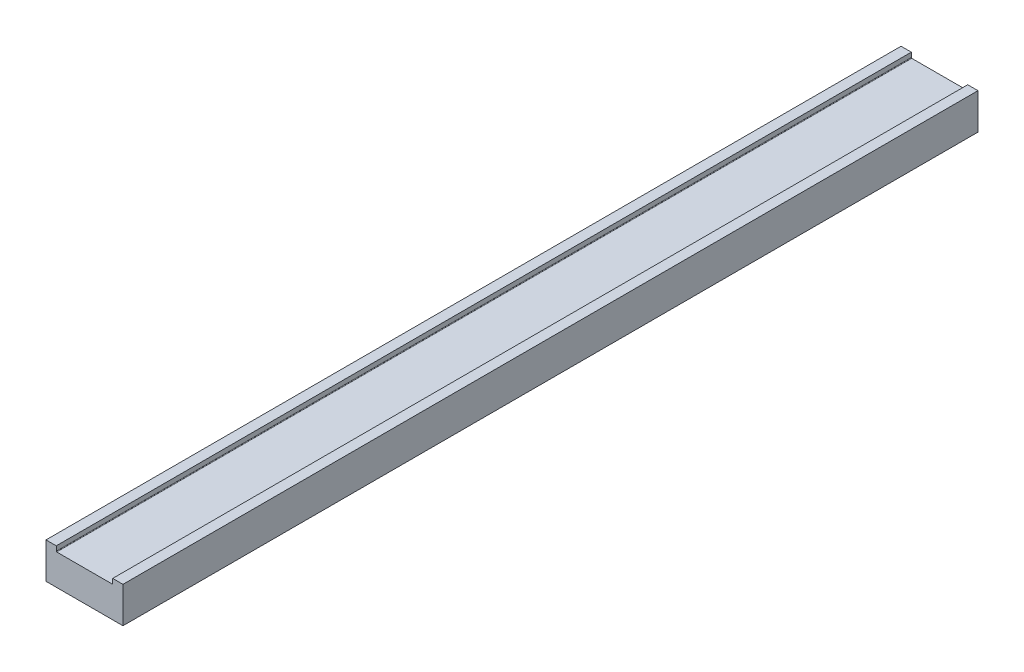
ISO-10303-21;
HEADER;
FILE_DESCRIPTION(('STEP AP214'),'2;1');
FILE_NAME('part.step','',(''),(''),'','','');
FILE_SCHEMA(('AUTOMOTIVE_DESIGN { 1 0 10303 214 1 1 1 1 }'));
ENDSEC;
DATA;
#1=APPLICATION_CONTEXT('core data for automotive mechanical design processes');
#2=APPLICATION_PROTOCOL_DEFINITION('international standard','automotive_design',2000,#1);
#3=PRODUCT_CONTEXT('',#1,'mechanical');
#4=PRODUCT('Part','Part','',(#3));
#5=PRODUCT_RELATED_PRODUCT_CATEGORY('part','',(#4));
#6=PRODUCT_DEFINITION_FORMATION('','',#4);
#7=PRODUCT_DEFINITION_CONTEXT('part definition',#1,'design');
#8=PRODUCT_DEFINITION('design','',#6,#7);
#9=PRODUCT_DEFINITION_SHAPE('','',#8);
#10=(LENGTH_UNIT() NAMED_UNIT(*) SI_UNIT(.MILLI.,.METRE.));
#11=(NAMED_UNIT(*) PLANE_ANGLE_UNIT() SI_UNIT($,.RADIAN.));
#12=(NAMED_UNIT(*) SI_UNIT($,.STERADIAN.) SOLID_ANGLE_UNIT());
#13=UNCERTAINTY_MEASURE_WITH_UNIT(LENGTH_MEASURE(1.E-05),#10,'distance_accuracy_value','');
#14=(GEOMETRIC_REPRESENTATION_CONTEXT(3) GLOBAL_UNCERTAINTY_ASSIGNED_CONTEXT((#13)) GLOBAL_UNIT_ASSIGNED_CONTEXT((#10,
#11,#12)) REPRESENTATION_CONTEXT('',''));
#15=CARTESIAN_POINT('',(0.,0.,0.));
#16=DIRECTION('',(0.,0.,1.));
#17=DIRECTION('',(1.,0.,0.));
#18=AXIS2_PLACEMENT_3D('',#15,#16,#17);
#19=CARTESIAN_POINT('',(-22.5,21.,0.));
#20=DIRECTION('',(-1.,0.,0.));
#21=DIRECTION('',(0.,0.,1.));
#22=AXIS2_PLACEMENT_3D('',#19,#20,#21);
#23=PLANE('',#22);
#24=DIRECTION('',(0.,0.,1.));
#25=VECTOR('',#24,1.);
#26=CARTESIAN_POINT('',(-22.5,21.,0.));
#27=LINE('',#26,#25);
#28=CARTESIAN_POINT('',(-22.5,21.,0.));
#29=VERTEX_POINT('',#28);
#30=CARTESIAN_POINT('',(-22.5,21.,500.));
#31=VERTEX_POINT('',#30);
#32=EDGE_CURVE('E9',#29,#31,#27,.T.);
#33=ORIENTED_EDGE('',*,*,#32,.F.);
#34=DIRECTION('',(0.,-1.,0.));
#35=VECTOR('',#34,1.);
#36=CARTESIAN_POINT('',(-22.5,21.,0.));
#37=LINE('',#36,#35);
#38=CARTESIAN_POINT('',(-22.5,0.,0.));
#39=VERTEX_POINT('',#38);
#40=EDGE_CURVE('E91',#29,#39,#37,.T.);
#41=ORIENTED_EDGE('',*,*,#40,.T.);
#42=DIRECTION('',(0.,0.,1.));
#43=VECTOR('',#42,1.);
#44=CARTESIAN_POINT('',(-22.5,0.,0.));
#45=LINE('',#44,#43);
#46=CARTESIAN_POINT('',(-22.5,0.,500.));
#47=VERTEX_POINT('',#46);
#48=EDGE_CURVE('E87',#39,#47,#45,.T.);
#49=ORIENTED_EDGE('',*,*,#48,.T.);
#50=DIRECTION('',(0.,-1.,0.));
#51=VECTOR('',#50,1.);
#52=CARTESIAN_POINT('',(-22.5,21.,500.));
#53=LINE('',#52,#51);
#54=EDGE_CURVE('E89',#31,#47,#53,.T.);
#55=ORIENTED_EDGE('',*,*,#54,.F.);
#56=EDGE_LOOP('',(#33,#41,#49,#55));
#57=FACE_BOUND('',#56,.T.);
#58=ADVANCED_FACE('F14',(#57),#23,.T.);
#59=CARTESIAN_POINT('',(-22.5,21.,0.));
#60=DIRECTION('',(0.,-1.,0.));
#61=DIRECTION('',(0.,0.,-1.));
#62=AXIS2_PLACEMENT_3D('',#59,#60,#61);
#63=PLANE('',#62);
#64=DIRECTION('',(0.,0.,1.));
#65=VECTOR('',#64,1.);
#66=CARTESIAN_POINT('',(-16.5,21.,0.));
#67=LINE('',#66,#65);
#68=CARTESIAN_POINT('',(-16.5,21.,0.));
#69=VERTEX_POINT('',#68);
#70=CARTESIAN_POINT('',(-16.5,21.,500.));
#71=VERTEX_POINT('',#70);
#72=EDGE_CURVE('E22',#69,#71,#67,.T.);
#73=ORIENTED_EDGE('',*,*,#72,.F.);
#74=DIRECTION('',(1.,0.,0.));
#75=VECTOR('',#74,1.);
#76=CARTESIAN_POINT('',(-22.5,21.,0.));
#77=LINE('',#76,#75);
#78=EDGE_CURVE('E97',#29,#69,#77,.T.);
#79=ORIENTED_EDGE('',*,*,#78,.F.);
#80=ORIENTED_EDGE('',*,*,#32,.T.);
#81=DIRECTION('',(1.,0.,0.));
#82=VECTOR('',#81,1.);
#83=CARTESIAN_POINT('',(-22.5,21.,500.));
#84=LINE('',#83,#82);
#85=EDGE_CURVE('E106',#31,#71,#84,.T.);
#86=ORIENTED_EDGE('',*,*,#85,.T.);
#87=EDGE_LOOP('',(#73,#79,#80,#86));
#88=FACE_BOUND('',#87,.T.);
#89=ADVANCED_FACE('F16',(#88),#63,.F.);
#90=CARTESIAN_POINT('',(-16.5,21.,0.));
#91=DIRECTION('',(-1.,0.,0.));
#92=DIRECTION('',(0.,0.,1.));
#93=AXIS2_PLACEMENT_3D('',#90,#91,#92);
#94=PLANE('',#93);
#95=DIRECTION('',(0.,0.,1.));
#96=VECTOR('',#95,1.);
#97=CARTESIAN_POINT('',(-16.5,18.3,0.));
#98=LINE('',#97,#96);
#99=CARTESIAN_POINT('',(-16.5,18.3,0.));
#100=VERTEX_POINT('',#99);
#101=CARTESIAN_POINT('',(-16.5,18.3,500.));
#102=VERTEX_POINT('',#101);
#103=EDGE_CURVE('E169',#100,#102,#98,.T.);
#104=ORIENTED_EDGE('',*,*,#103,.F.);
#105=DIRECTION('',(0.,-1.,0.));
#106=VECTOR('',#105,1.);
#107=CARTESIAN_POINT('',(-16.5,21.,0.));
#108=LINE('',#107,#106);
#109=EDGE_CURVE('E153',#69,#100,#108,.T.);
#110=ORIENTED_EDGE('',*,*,#109,.F.);
#111=ORIENTED_EDGE('',*,*,#72,.T.);
#112=DIRECTION('',(0.,-1.,0.));
#113=VECTOR('',#112,1.);
#114=CARTESIAN_POINT('',(-16.5,21.,500.));
#115=LINE('',#114,#113);
#116=EDGE_CURVE('E128',#71,#102,#115,.T.);
#117=ORIENTED_EDGE('',*,*,#116,.T.);
#118=EDGE_LOOP('',(#104,#110,#111,#117));
#119=FACE_BOUND('',#118,.T.);
#120=ADVANCED_FACE('F171',(#119),#94,.F.);
#121=CARTESIAN_POINT('',(-16.2,18.3,0.));
#122=DIRECTION('',(0.,0.,1.));
#123=DIRECTION('',(1.,0.,0.));
#124=AXIS2_PLACEMENT_3D('',#121,#122,#123);
#125=CYLINDRICAL_SURFACE('',#124,0.299999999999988);
#126=DIRECTION('',(0.,0.,1.));
#127=VECTOR('',#126,1.);
#128=CARTESIAN_POINT('',(-16.2,18.,0.));
#129=LINE('',#128,#127);
#130=CARTESIAN_POINT('',(-16.2,18.,0.));
#131=VERTEX_POINT('',#130);
#132=CARTESIAN_POINT('',(-16.2,18.,500.));
#133=VERTEX_POINT('',#132);
#134=EDGE_CURVE('E167',#131,#133,#129,.T.);
#135=ORIENTED_EDGE('',*,*,#134,.F.);
#136=CARTESIAN_POINT('',(-16.2,18.3,0.));
#137=DIRECTION('',(0.,0.,1.));
#138=DIRECTION('',(1.,0.,0.));
#139=AXIS2_PLACEMENT_3D('',#136,#137,#138);
#140=CIRCLE('',#139,0.299999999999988);
#141=EDGE_CURVE('E150',#100,#131,#140,.T.);
#142=ORIENTED_EDGE('',*,*,#141,.F.);
#143=ORIENTED_EDGE('',*,*,#103,.T.);
#144=CARTESIAN_POINT('',(-16.2,18.3,500.));
#145=DIRECTION('',(0.,0.,1.));
#146=DIRECTION('',(1.,0.,0.));
#147=AXIS2_PLACEMENT_3D('',#144,#145,#146);
#148=CIRCLE('',#147,0.299999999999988);
#149=EDGE_CURVE('E125',#102,#133,#148,.T.);
#150=ORIENTED_EDGE('',*,*,#149,.T.);
#151=EDGE_LOOP('',(#135,#142,#143,#150));
#152=FACE_BOUND('',#151,.T.);
#153=ADVANCED_FACE('F195',(#152),#125,.F.);
#154=CARTESIAN_POINT('',(-16.2,18.,0.));
#155=DIRECTION('',(0.,-1.,0.));
#156=DIRECTION('',(1.,0.,0.));
#157=AXIS2_PLACEMENT_3D('',#154,#155,#156);
#158=PLANE('',#157);
#159=DIRECTION('',(0.,0.,1.));
#160=VECTOR('',#159,1.);
#161=CARTESIAN_POINT('',(16.2,18.,0.));
#162=LINE('',#161,#160);
#163=CARTESIAN_POINT('',(16.2,18.,0.));
#164=VERTEX_POINT('',#163);
#165=CARTESIAN_POINT('',(16.2,18.,500.));
#166=VERTEX_POINT('',#165);
#167=EDGE_CURVE('E165',#164,#166,#162,.T.);
#168=ORIENTED_EDGE('',*,*,#167,.F.);
#169=DIRECTION('',(1.,0.,0.));
#170=VECTOR('',#169,1.);
#171=CARTESIAN_POINT('',(-16.2,18.,0.));
#172=LINE('',#171,#170);
#173=EDGE_CURVE('E147',#131,#164,#172,.T.);
#174=ORIENTED_EDGE('',*,*,#173,.F.);
#175=ORIENTED_EDGE('',*,*,#134,.T.);
#176=DIRECTION('',(1.,0.,0.));
#177=VECTOR('',#176,1.);
#178=CARTESIAN_POINT('',(-16.2,18.,500.));
#179=LINE('',#178,#177);
#180=EDGE_CURVE('E122',#133,#166,#179,.T.);
#181=ORIENTED_EDGE('',*,*,#180,.T.);
#182=EDGE_LOOP('',(#168,#174,#175,#181));
#183=FACE_BOUND('',#182,.T.);
#184=ADVANCED_FACE('F193',(#183),#158,.F.);
#185=CARTESIAN_POINT('',(16.2,18.3,0.));
#186=DIRECTION('',(0.,0.,1.));
#187=DIRECTION('',(1.,0.,0.));
#188=AXIS2_PLACEMENT_3D('',#185,#186,#187);
#189=CYLINDRICAL_SURFACE('',#188,0.299999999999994);
#190=DIRECTION('',(0.,0.,1.));
#191=VECTOR('',#190,1.);
#192=CARTESIAN_POINT('',(16.5,18.3,0.));
#193=LINE('',#192,#191);
#194=CARTESIAN_POINT('',(16.5,18.3,0.));
#195=VERTEX_POINT('',#194);
#196=CARTESIAN_POINT('',(16.5,18.3,500.));
#197=VERTEX_POINT('',#196);
#198=EDGE_CURVE('E163',#195,#197,#193,.T.);
#199=ORIENTED_EDGE('',*,*,#198,.F.);
#200=CARTESIAN_POINT('',(16.2,18.3,0.));
#201=DIRECTION('',(0.,0.,1.));
#202=DIRECTION('',(1.,0.,0.));
#203=AXIS2_PLACEMENT_3D('',#200,#201,#202);
#204=CIRCLE('',#203,0.299999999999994);
#205=EDGE_CURVE('E144',#164,#195,#204,.T.);
#206=ORIENTED_EDGE('',*,*,#205,.F.);
#207=ORIENTED_EDGE('',*,*,#167,.T.);
#208=CARTESIAN_POINT('',(16.2,18.3,500.));
#209=DIRECTION('',(0.,0.,1.));
#210=DIRECTION('',(1.,0.,0.));
#211=AXIS2_PLACEMENT_3D('',#208,#209,#210);
#212=CIRCLE('',#211,0.299999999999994);
#213=EDGE_CURVE('E119',#166,#197,#212,.T.);
#214=ORIENTED_EDGE('',*,*,#213,.T.);
#215=EDGE_LOOP('',(#199,#206,#207,#214));
#216=FACE_BOUND('',#215,.T.);
#217=ADVANCED_FACE('F189',(#216),#189,.F.);
#218=CARTESIAN_POINT('',(16.5,21.,0.));
#219=DIRECTION('',(-1.,0.,0.));
#220=DIRECTION('',(0.,0.,1.));
#221=AXIS2_PLACEMENT_3D('',#218,#219,#220);
#222=PLANE('',#221);
#223=DIRECTION('',(0.,0.,1.));
#224=VECTOR('',#223,1.);
#225=CARTESIAN_POINT('',(16.5,21.,0.));
#226=LINE('',#225,#224);
#227=CARTESIAN_POINT('',(16.5,21.,0.));
#228=VERTEX_POINT('',#227);
#229=CARTESIAN_POINT('',(16.5,21.,500.));
#230=VERTEX_POINT('',#229);
#231=EDGE_CURVE('E161',#228,#230,#226,.T.);
#232=ORIENTED_EDGE('',*,*,#231,.F.);
#233=DIRECTION('',(0.,-1.,0.));
#234=VECTOR('',#233,1.);
#235=CARTESIAN_POINT('',(16.5,21.,0.));
#236=LINE('',#235,#234);
#237=EDGE_CURVE('E141',#228,#195,#236,.T.);
#238=ORIENTED_EDGE('',*,*,#237,.T.);
#239=ORIENTED_EDGE('',*,*,#198,.T.);
#240=DIRECTION('',(0.,-1.,0.));
#241=VECTOR('',#240,1.);
#242=CARTESIAN_POINT('',(16.5,21.,500.));
#243=LINE('',#242,#241);
#244=EDGE_CURVE('E116',#230,#197,#243,.T.);
#245=ORIENTED_EDGE('',*,*,#244,.F.);
#246=EDGE_LOOP('',(#232,#238,#239,#245));
#247=FACE_BOUND('',#246,.T.);
#248=ADVANCED_FACE('F186',(#247),#222,.T.);
#249=CARTESIAN_POINT('',(16.5,21.,0.));
#250=DIRECTION('',(0.,-1.,0.));
#251=DIRECTION('',(1.,0.,0.));
#252=AXIS2_PLACEMENT_3D('',#249,#250,#251);
#253=PLANE('',#252);
#254=DIRECTION('',(0.,0.,1.));
#255=VECTOR('',#254,1.);
#256=CARTESIAN_POINT('',(22.5,21.,0.));
#257=LINE('',#256,#255);
#258=CARTESIAN_POINT('',(22.5,21.,0.));
#259=VERTEX_POINT('',#258);
#260=CARTESIAN_POINT('',(22.5,21.,500.));
#261=VERTEX_POINT('',#260);
#262=EDGE_CURVE('E159',#259,#261,#257,.T.);
#263=ORIENTED_EDGE('',*,*,#262,.F.);
#264=DIRECTION('',(1.,0.,0.));
#265=VECTOR('',#264,1.);
#266=CARTESIAN_POINT('',(16.5,21.,0.));
#267=LINE('',#266,#265);
#268=EDGE_CURVE('E138',#228,#259,#267,.T.);
#269=ORIENTED_EDGE('',*,*,#268,.F.);
#270=ORIENTED_EDGE('',*,*,#231,.T.);
#271=DIRECTION('',(1.,0.,0.));
#272=VECTOR('',#271,1.);
#273=CARTESIAN_POINT('',(16.5,21.,500.));
#274=LINE('',#273,#272);
#275=EDGE_CURVE('E111',#230,#261,#274,.T.);
#276=ORIENTED_EDGE('',*,*,#275,.T.);
#277=EDGE_LOOP('',(#263,#269,#270,#276));
#278=FACE_BOUND('',#277,.T.);
#279=ADVANCED_FACE('F184',(#278),#253,.F.);
#280=CARTESIAN_POINT('',(22.5,21.,0.));
#281=DIRECTION('',(-1.,0.,0.));
#282=DIRECTION('',(0.,0.,1.));
#283=AXIS2_PLACEMENT_3D('',#280,#281,#282);
#284=PLANE('',#283);
#285=DIRECTION('',(0.,0.,1.));
#286=VECTOR('',#285,1.);
#287=CARTESIAN_POINT('',(22.5,0.,0.));
#288=LINE('',#287,#286);
#289=CARTESIAN_POINT('',(22.5,0.,0.));
#290=VERTEX_POINT('',#289);
#291=CARTESIAN_POINT('',(22.5,0.,500.));
#292=VERTEX_POINT('',#291);
#293=EDGE_CURVE('E96',#290,#292,#288,.T.);
#294=ORIENTED_EDGE('',*,*,#293,.F.);
#295=DIRECTION('',(0.,-1.,0.));
#296=VECTOR('',#295,1.);
#297=CARTESIAN_POINT('',(22.5,21.,0.));
#298=LINE('',#297,#296);
#299=EDGE_CURVE('E135',#259,#290,#298,.T.);
#300=ORIENTED_EDGE('',*,*,#299,.F.);
#301=ORIENTED_EDGE('',*,*,#262,.T.);
#302=DIRECTION('',(0.,-1.,0.));
#303=VECTOR('',#302,1.);
#304=CARTESIAN_POINT('',(22.5,21.,500.));
#305=LINE('',#304,#303);
#306=EDGE_CURVE('E109',#261,#292,#305,.T.);
#307=ORIENTED_EDGE('',*,*,#306,.T.);
#308=EDGE_LOOP('',(#294,#300,#301,#307));
#309=FACE_BOUND('',#308,.T.);
#310=ADVANCED_FACE('F180',(#309),#284,.F.);
#311=CARTESIAN_POINT('',(-22.5,0.,0.));
#312=DIRECTION('',(0.,-1.,0.));
#313=DIRECTION('',(0.,0.,-1.));
#314=AXIS2_PLACEMENT_3D('',#311,#312,#313);
#315=PLANE('',#314);
#316=DIRECTION('',(1.,0.,0.));
#317=VECTOR('',#316,1.);
#318=CARTESIAN_POINT('',(-22.5,0.,0.));
#319=LINE('',#318,#317);
#320=EDGE_CURVE('E133',#39,#290,#319,.T.);
#321=ORIENTED_EDGE('',*,*,#320,.T.);
#322=ORIENTED_EDGE('',*,*,#293,.T.);
#323=DIRECTION('',(1.,0.,0.));
#324=VECTOR('',#323,1.);
#325=CARTESIAN_POINT('',(-22.5,0.,500.));
#326=LINE('',#325,#324);
#327=EDGE_CURVE('E103',#47,#292,#326,.T.);
#328=ORIENTED_EDGE('',*,*,#327,.F.);
#329=ORIENTED_EDGE('',*,*,#48,.F.);
#330=EDGE_LOOP('',(#321,#322,#328,#329));
#331=FACE_BOUND('',#330,.T.);
#332=ADVANCED_FACE('F108',(#331),#315,.T.);
#333=CARTESIAN_POINT('',(16.2,18.3,0.));
#334=DIRECTION('',(0.,0.,1.));
#335=DIRECTION('',(1.,0.,0.));
#336=AXIS2_PLACEMENT_3D('',#333,#334,#335);
#337=PLANE('',#336);
#338=ORIENTED_EDGE('',*,*,#40,.F.);
#339=ORIENTED_EDGE('',*,*,#78,.T.);
#340=ORIENTED_EDGE('',*,*,#109,.T.);
#341=ORIENTED_EDGE('',*,*,#141,.T.);
#342=ORIENTED_EDGE('',*,*,#173,.T.);
#343=ORIENTED_EDGE('',*,*,#205,.T.);
#344=ORIENTED_EDGE('',*,*,#237,.F.);
#345=ORIENTED_EDGE('',*,*,#268,.T.);
#346=ORIENTED_EDGE('',*,*,#299,.T.);
#347=ORIENTED_EDGE('',*,*,#320,.F.);
#348=EDGE_LOOP('',(#338,#339,#340,#341,#342,#343,#344,#345,#346,#347));
#349=FACE_BOUND('',#348,.T.);
#350=ADVANCED_FACE('F175',(#349),#337,.F.);
#351=CARTESIAN_POINT('',(16.2,18.3,500.));
#352=DIRECTION('',(0.,0.,1.));
#353=DIRECTION('',(1.,0.,0.));
#354=AXIS2_PLACEMENT_3D('',#351,#352,#353);
#355=PLANE('',#354);
#356=ORIENTED_EDGE('',*,*,#54,.T.);
#357=ORIENTED_EDGE('',*,*,#327,.T.);
#358=ORIENTED_EDGE('',*,*,#306,.F.);
#359=ORIENTED_EDGE('',*,*,#275,.F.);
#360=ORIENTED_EDGE('',*,*,#244,.T.);
#361=ORIENTED_EDGE('',*,*,#213,.F.);
#362=ORIENTED_EDGE('',*,*,#180,.F.);
#363=ORIENTED_EDGE('',*,*,#149,.F.);
#364=ORIENTED_EDGE('',*,*,#116,.F.);
#365=ORIENTED_EDGE('',*,*,#85,.F.);
#366=EDGE_LOOP('',(#356,#357,#358,#359,#360,#361,#362,#363,#364,#365));
#367=FACE_BOUND('',#366,.T.);
#368=ADVANCED_FACE('F101',(#367),#355,.T.);
#369=CLOSED_SHELL('',(#58,#89,#120,#153,#184,#217,#248,#279,#310,#332,#350,#368));
#370=MANIFOLD_SOLID_BREP('B1',#369);
#371=ADVANCED_BREP_SHAPE_REPRESENTATION('',(#18,#370),#14);
#372=SHAPE_DEFINITION_REPRESENTATION(#9,#371);
ENDSEC;
END-ISO-10303-21;
